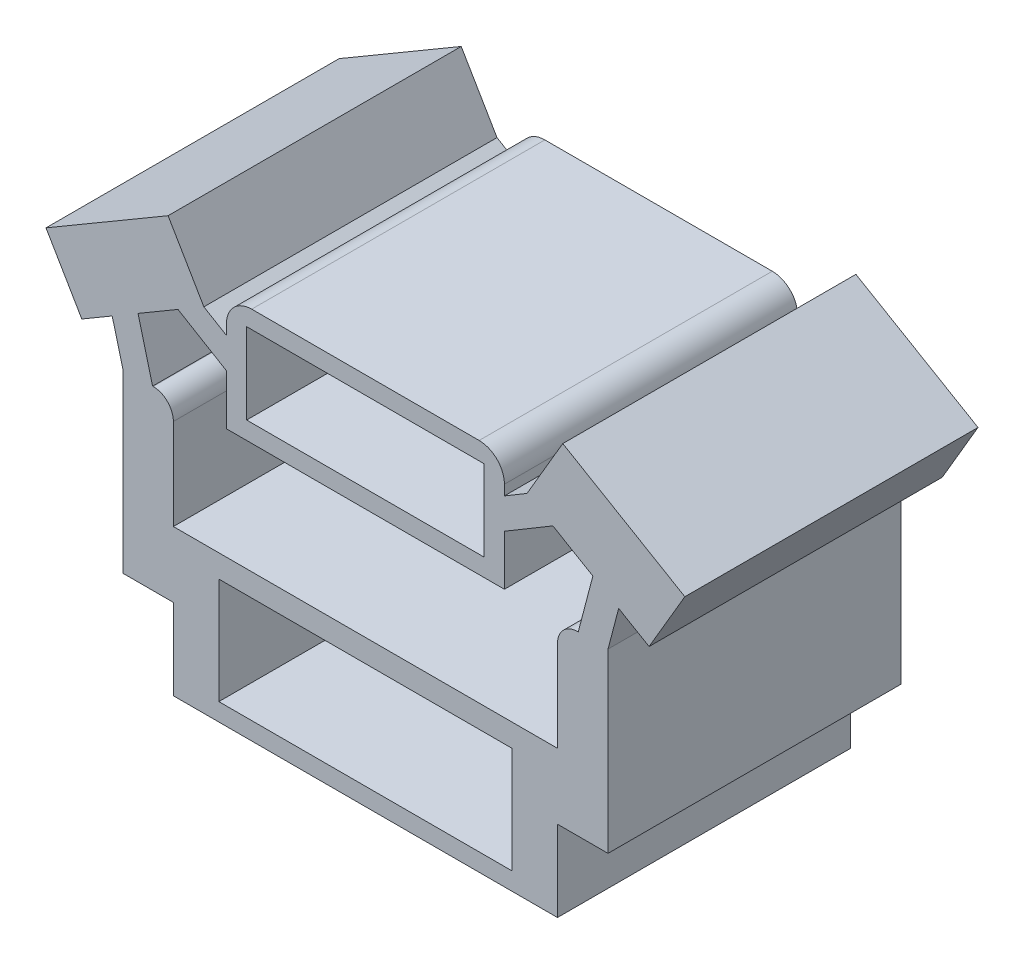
from build123d import *

# Parameters (mm, degrees)
EXTRUDE_1_DEPTH     = 5.8
SKETCH_10_W         = 5.8
SKETCH_10_H         = 2.1
SKETCH_10_W_2       = 4.7
SKETCH_10_H_2       = 1.6
CUT_EXTRUDE_3_DEPTH = 11.868653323
EXTRUDE_2_DEPTH     = 5.8
FILLET_1_R          = 0.5
SKETCH_12_W         = 5.8
SKETCH_12_H         = 0.1
SKETCH_12_W_2       = 7.6
EXTRUDE_3_DEPTH     = 5.8
SKETCH_14_W         = 5.8
SKETCH_14_H         = 0.1
CUT_EXTRUDE_4_DEPTH = 11.868653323
FILLET_2_R          = 0.4


with BuildPart() as part:
    # Sketch 1 → Extrude 1 (new body)
    with BuildSketch(Plane.XY):
        Polygon((2.75, 5.2), (3.196659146, 5.46626229), (3.904703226, 6.674017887), (6.320214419, 5.257929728), (5.61217034, 4.050174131), (5.010619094, 4.402832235), (4.8, 3.6), (4.8, 0.1), (3.8, 0.1), (3.8, -1.4), (-3.8, -1.4), (-3.8, 1.4), (3.8, 1.4), (3.8, 3.6), (4.210711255, 3.6), (4.499881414, 4.702251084), (3.70866861, 5.16609786), (2.75, 4.594616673), (2.75, 3.6), (-2.75, 3.6), (-2.75, 5.2), align=None)
    extrude_1 = extrude(amount=EXTRUDE_1_DEPTH)

    # Mirror 1: Extrude 1 across plane
    add(extrude_1.mirror(Plane(origin=(0, 0, 0), x_dir=(0, 0, 1), z_dir=(1, 0, 0))))

    # Sketch 10 → Cut-Extrude 3 (cut, through all)
    with BuildSketch(Plane.XY.offset(5.8)):
        Rectangle(SKETCH_10_W, SKETCH_10_H)
        with Locations((0, 4.75)):
            Rectangle(SKETCH_10_W_2, SKETCH_10_H_2)
    extrude(amount=-CUT_EXTRUDE_3_DEPTH, mode=Mode.SUBTRACT)

    # Sketch 11 → Extrude 2 (add)
    with BuildSketch(Plane.XY.offset(5.8)):
        Polygon((-2.35, 5.2), (-2.75, 5.2), (-2.75, 5.9), (2.75, 5.9), (2.75, 5.2), (2.35, 5.2), (2.35, 5.55), (-2.35, 5.55), align=None)
    extrude(amount=-EXTRUDE_2_DEPTH)

    # Fillet 1
    fillet_1_edges = [part.edges().sort_by_distance(p)[0] for p in [
        (2.75, 5.9, 2.9),
        (-2.75, 5.9, 2.9),
    ]]
    fillet(fillet_1_edges, radius=FILLET_1_R)

    # Sketch 12 → Extrude 3 (add)
    with BuildSketch(Plane.XY.offset(5.8)):
        with Locations((0, 1)):
            Rectangle(SKETCH_12_W, SKETCH_12_H)
        with Locations((0, -1.45)):
            Rectangle(SKETCH_12_W_2, SKETCH_12_H)
    extrude(amount=-EXTRUDE_3_DEPTH)

    # Sketch 14 → Cut-Extrude 4 (cut, through all)
    with BuildSketch(Plane.XY.offset(5.8)):
        with Locations((0, -1.1)):
            Rectangle(SKETCH_14_W, SKETCH_14_H)
    extrude(amount=-CUT_EXTRUDE_4_DEPTH, mode=Mode.SUBTRACT)

    # Fillet 2
    fillet_2_edges = [part.edges().sort_by_distance(p)[0] for p in [
        (3.8, 3.6, 2.9),
        (-3.8, 3.6, 2.9),
    ]]
    fillet(fillet_2_edges, radius=FILLET_2_R)


solid = part.part
